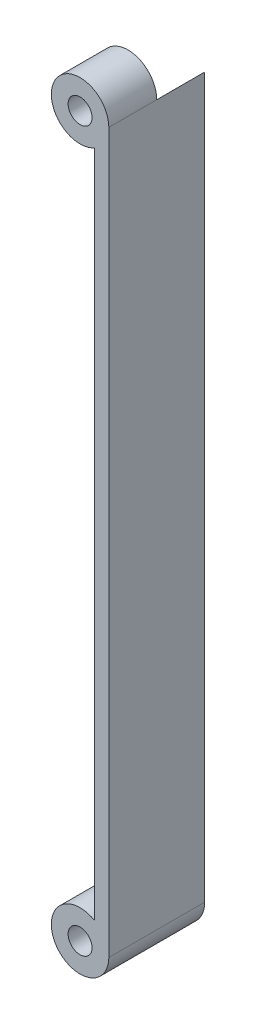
from build123d import *

# Parameters (mm, degrees)
ESQUISSE1_R             = 2.5
BOSS_EXTRU_1_DEPTH      = 20
ESQUISSE2_R             = 6
ENL_V_MAT_EXTRU_1_DEPTH = 10


with BuildPart() as part:
    # Esquisse1 → Boss.-Extru.1 (new body)
    with BuildSketch(Plane.XY):
        with BuildLine():
            Line((6, 150), (6, 0))
            ThreePointArc((6, 0), (-5.196152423, -3), (3, 5.196152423))
            Line((3, 5.196152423), (3, 144.803847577))
            ThreePointArc((3, 144.803847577), (-5.196152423, 153), (6, 150))
        make_face()
        Circle(ESQUISSE1_R, mode=Mode.SUBTRACT)
        with Locations((0, 150)):
            Circle(ESQUISSE1_R, mode=Mode.SUBTRACT)
    extrude(amount=BOSS_EXTRU_1_DEPTH)

    # Esquisse2 → Enl_v. mat.-Extru.1 (cut)
    with BuildSketch(Plane(origin=(0, 0, 0), x_dir=(-1, 0, 0), z_dir=(0, 0, -1))):
        with Locations((0, 150)):
            Circle(ESQUISSE2_R)
    extrude(amount=-ENL_V_MAT_EXTRU_1_DEPTH, mode=Mode.SUBTRACT)


solid = part.part
